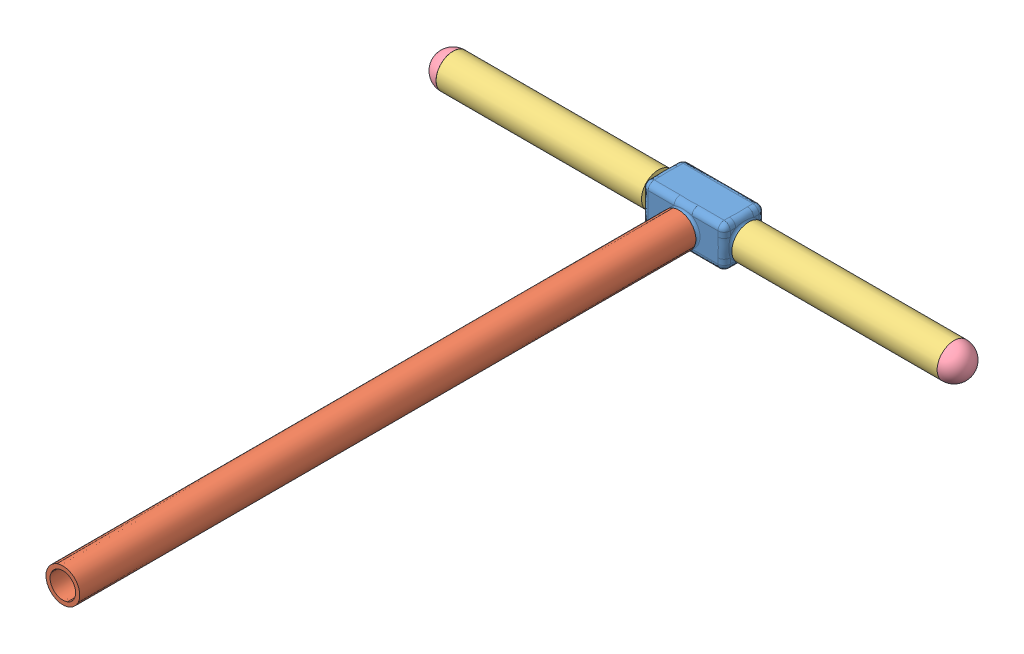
SolidWorks assembly assemb_eau.SLDASM, configuration Défaut (file format 17000). Lengths in mm.
Overall size (260.48 23.02 323.38).
6 component instances, 4 part files, 10 mates.
Components (placement in the parent):
- T-1: T.SLDPRT [Défaut] at (-2.1646 3.58 41.0675) size (80 20 40)
- tube_principal-1: tube_principal.SLDPRT [Défaut] at (-2.1646 3.58 63.0327) x (0.813207 0.581974 0) z (0 0 1) size (16.5 16.5 300)
- tube_secondaire-1: tube_secondaire.SLDPRT [Défaut] at (19.7978 3.5797 51.0674) x (1 0 0) z (0 -0.546051 0.837752) size (100 16.5 16.5)
- tube_secondaire-2: tube_secondaire.SLDPRT [Défaut] at (-124.1819 3.58 51.0676) size (100 16.5 16.5)
- bouchon-1: bouchon.SLDPRT [Défaut] at (-114.1819 3.58 51.0675) x (0 0 1) z (-1 0 0) size (16.5 16.5 18.25)
- bouchon-2: bouchon.SLDPRT [Défaut] at (109.7978 3.58 51.0675) x (0 0 -1) z (1 0 0) size (16.5 16.5 18.25)
Mates (geometry in assembly coordinates):
- Coaxiale1: concentric aligned: cylinder of T-1 through (-2.1646 3.58 81.0675) axis (0 0 -1) radius 6.25; cylinder of tube_principal-1 through (-2.1646 3.58 363.0327) axis (0 0 -1) radius 6.25
- Tangent1: tangent: torus of T-1; circle of tube_principal-1
- Coaxiale2: concentric aligned: cylinder of tube_secondaire-1 through (119.7978 3.5797 51.0674) axis (-1 0 0) radius 6.25; cylinder of bouchon-2 through (119.7978 3.58 51.0675) axis (-1 0 0) radius 6.25
- Coïncidente1: coincident anti-aligned: plane of tube_secondaire-1 through (119.7978 3.5797 51.0674) normal (1 0 0); plane of bouchon-2 through (119.7978 3.58 51.0675) normal (-1 0 0)
- Coaxiale3: concentric anti-aligned: cylinder of tube_secondaire-2 through (-24.1819 3.58 51.0676) axis (-1 0 0) radius 6.25; cylinder of bouchon-1 through (-124.1819 3.58 51.0675) axis (1 0 0) radius 6.25
- Coïncidente2: coincident anti-aligned: plane of tube_secondaire-2 through (-124.1819 3.58 51.0676) normal (-1 0 0); plane of bouchon-1 through (-124.1819 3.58 51.0675) normal (1 0 0)
- Coaxiale4: concentric anti-aligned: cylinder of T-1 through (-42.1646 3.58 51.0675) axis (1 0 0) radius 6.25; cylinder of tube_secondaire-2 through (-24.1819 3.58 51.0676) axis (-1 0 0) radius 6.25
- Tangent2: tangent: torus of T-1; circle of tube_secondaire-2
- Coaxiale5: concentric aligned: cylinder of T-1 through (37.8354 3.58 51.0675) axis (-1 0 0) radius 6.25; cylinder of tube_secondaire-1 through (119.7978 3.5797 51.0674) axis (-1 0 0) radius 6.25
- Tangent6: tangent: torus of T-1; circle of tube_secondaire-1
